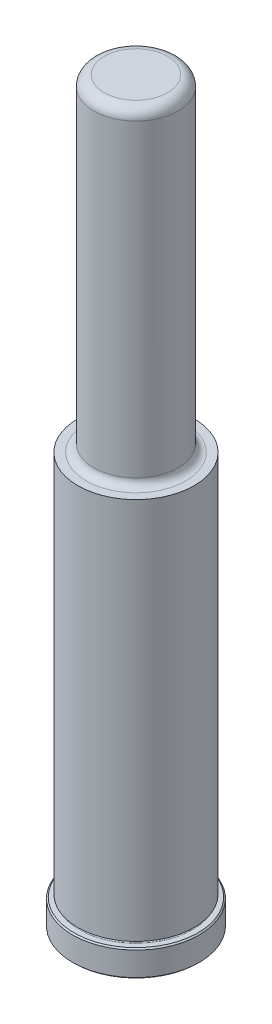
from build123d import *

# Parameters (mm, degrees)
CHAMFER1_SIZE = 0.381
FILLET7_R     = 3.175


with BuildPart() as part:
    # Sketch1 → Revolve1 (revolve)
    with BuildSketch(Plane(origin=(0, 0, 0), x_dir=(0, 0, -1), z_dir=(1, 0, 0)), mode=Mode.PRIVATE) as revolve1_sk:
        with BuildLine():
            Line((0, 0), (19.05, 0))
            Line((19.05, 0), (19.05, 7.9248))
            Line((19.05, 7.9248), (17.0688, 7.9248))
            ThreePointArc((17.0688, 7.9248), (16.6878, 8.3058), (17.0688, 8.6868))
            Line((17.0688, 8.6868), (17.4752, 8.6868))
            Line((17.4752, 8.6868), (17.4752, 123.825))
            Line((17.4752, 123.825), (14.9733, 123.825))
            ThreePointArc((14.9733, 123.825), (13.356853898, 124.494553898), (12.6873, 126.111))
            Line((12.6873, 126.111), (12.6873, 222.25))
            Line((12.6873, 222.25), (0, 222.25))
            Line((0, 222.25), (0, 0))
        make_face()
    revolve(revolve1_sk.sketch.rotate(Axis((0, 0, 0), (0, -1, 0)), 180), axis=Axis((0, 0, 0), (0, -1, 0)))

    # Chamfer1
    chamfer1_edges = [part.edges().sort_by_distance(p)[0] for p in [
        (0, 7.9248, -19.05),
        (0, 0, -19.05),
    ]]
    chamfer(chamfer1_edges, length=CHAMFER1_SIZE)

    # Fillet7
    fillet7_edges = [part.edges().sort_by_distance(p)[0] for p in [
        (0, 222.25, -12.6873),
    ]]
    fillet(fillet7_edges, radius=FILLET7_R)


solid = part.part
